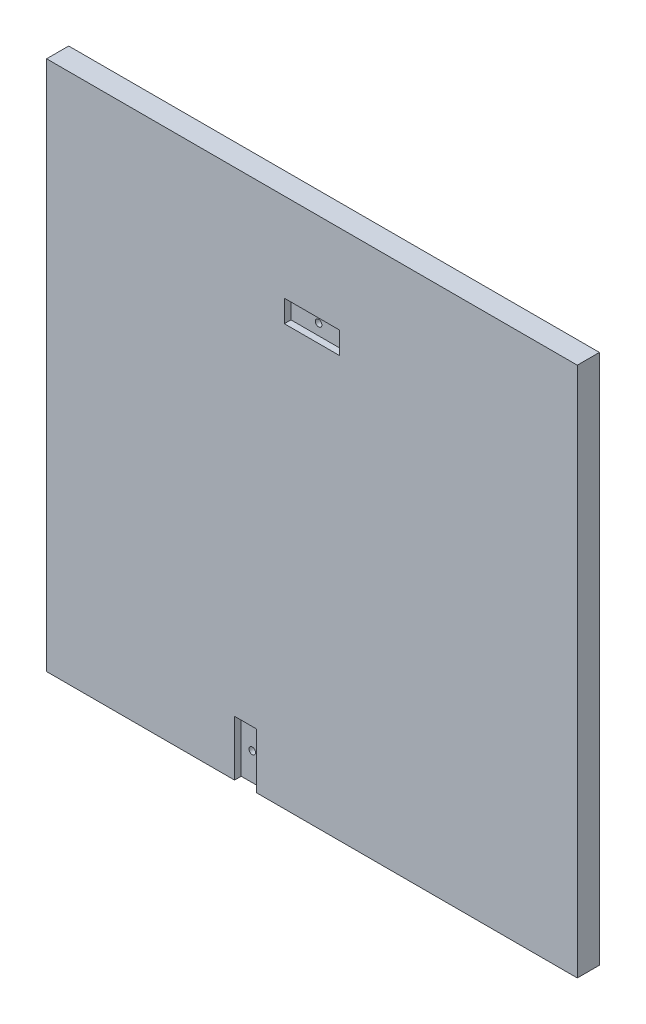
ISO-10303-21;
HEADER;
FILE_DESCRIPTION(('STEP AP214'),'2;1');
FILE_NAME('part.step','',(''),(''),'','','');
FILE_SCHEMA(('AUTOMOTIVE_DESIGN { 1 0 10303 214 1 1 1 1 }'));
ENDSEC;
DATA;
#1=APPLICATION_CONTEXT('core data for automotive mechanical design processes');
#2=APPLICATION_PROTOCOL_DEFINITION('international standard','automotive_design',2000,#1);
#3=PRODUCT_CONTEXT('',#1,'mechanical');
#4=PRODUCT('Part','Part','',(#3));
#5=PRODUCT_RELATED_PRODUCT_CATEGORY('part','',(#4));
#6=PRODUCT_DEFINITION_FORMATION('','',#4);
#7=PRODUCT_DEFINITION_CONTEXT('part definition',#1,'design');
#8=PRODUCT_DEFINITION('design','',#6,#7);
#9=PRODUCT_DEFINITION_SHAPE('','',#8);
#10=(LENGTH_UNIT() NAMED_UNIT(*) SI_UNIT(.MILLI.,.METRE.));
#11=(NAMED_UNIT(*) PLANE_ANGLE_UNIT() SI_UNIT($,.RADIAN.));
#12=(NAMED_UNIT(*) SI_UNIT($,.STERADIAN.) SOLID_ANGLE_UNIT());
#13=UNCERTAINTY_MEASURE_WITH_UNIT(LENGTH_MEASURE(1.E-05),#10,'distance_accuracy_value','');
#14=(GEOMETRIC_REPRESENTATION_CONTEXT(3) GLOBAL_UNCERTAINTY_ASSIGNED_CONTEXT((#13)) GLOBAL_UNIT_ASSIGNED_CONTEXT((#10,
#11,#12)) REPRESENTATION_CONTEXT('',''));
#15=CARTESIAN_POINT('',(0.,0.,0.));
#16=DIRECTION('',(0.,0.,1.));
#17=DIRECTION('',(1.,0.,0.));
#18=AXIS2_PLACEMENT_3D('',#15,#16,#17);
#19=CARTESIAN_POINT('',(120.,195.,0.));
#20=DIRECTION('',(0.,0.,1.));
#21=DIRECTION('',(1.,0.,0.));
#22=AXIS2_PLACEMENT_3D('',#19,#20,#21);
#23=CYLINDRICAL_SURFACE('',#22,1.5);
#24=CARTESIAN_POINT('',(120.,195.,0.));
#25=DIRECTION('',(0.,0.,1.));
#26=DIRECTION('',(1.,0.,0.));
#27=AXIS2_PLACEMENT_3D('',#24,#25,#26);
#28=CIRCLE('',#27,1.5);
#29=CARTESIAN_POINT('',(121.5,195.,0.));
#30=VERTEX_POINT('',#29);
#31=EDGE_CURVE('E191',#30,#30,#28,.T.);
#32=ORIENTED_EDGE('',*,*,#31,.F.);
#33=EDGE_LOOP('',(#32));
#34=FACE_BOUND('',#33,.T.);
#35=CARTESIAN_POINT('',(120.,195.,7.));
#36=DIRECTION('',(0.,0.,1.));
#37=DIRECTION('',(1.,0.,0.));
#38=AXIS2_PLACEMENT_3D('',#35,#36,#37);
#39=CIRCLE('',#38,1.5);
#40=CARTESIAN_POINT('',(121.5,195.,7.));
#41=VERTEX_POINT('',#40);
#42=EDGE_CURVE('E36',#41,#41,#39,.F.);
#43=ORIENTED_EDGE('',*,*,#42,.F.);
#44=EDGE_LOOP('',(#43));
#45=FACE_BOUND('',#44,.T.);
#46=ADVANCED_FACE('F32',(#34,#45),#23,.F.);
#47=CARTESIAN_POINT('',(90.,12.5,0.));
#48=DIRECTION('',(0.,0.,1.));
#49=DIRECTION('',(1.,0.,0.));
#50=AXIS2_PLACEMENT_3D('',#47,#48,#49);
#51=CYLINDRICAL_SURFACE('',#50,1.5);
#52=CARTESIAN_POINT('',(90.,12.5,0.));
#53=DIRECTION('',(0.,0.,1.));
#54=DIRECTION('',(1.,0.,0.));
#55=AXIS2_PLACEMENT_3D('',#52,#53,#54);
#56=CIRCLE('',#55,1.5);
#57=CARTESIAN_POINT('',(91.5,12.5,0.));
#58=VERTEX_POINT('',#57);
#59=EDGE_CURVE('E194',#58,#58,#56,.T.);
#60=ORIENTED_EDGE('',*,*,#59,.F.);
#61=EDGE_LOOP('',(#60));
#62=FACE_BOUND('',#61,.T.);
#63=CARTESIAN_POINT('',(90.,12.5,7.));
#64=DIRECTION('',(0.,0.,1.));
#65=DIRECTION('',(1.,0.,0.));
#66=AXIS2_PLACEMENT_3D('',#63,#64,#65);
#67=CIRCLE('',#66,1.5);
#68=CARTESIAN_POINT('',(91.5,12.5,7.));
#69=VERTEX_POINT('',#68);
#70=EDGE_CURVE('E185',#69,#69,#67,.F.);
#71=ORIENTED_EDGE('',*,*,#70,.F.);
#72=EDGE_LOOP('',(#71));
#73=FACE_BOUND('',#72,.T.);
#74=ADVANCED_FACE('F229',(#62,#73),#51,.F.);
#75=CARTESIAN_POINT('',(0.,0.,10.));
#76=DIRECTION('',(1.,0.,0.));
#77=DIRECTION('',(0.,0.,-1.));
#78=AXIS2_PLACEMENT_3D('',#75,#76,#77);
#79=PLANE('',#78);
#80=DIRECTION('',(0.,-1.,0.));
#81=VECTOR('',#80,1.);
#82=CARTESIAN_POINT('',(0.,0.,0.));
#83=LINE('',#82,#81);
#84=CARTESIAN_POINT('',(0.,240.,0.));
#85=VERTEX_POINT('',#84);
#86=CARTESIAN_POINT('',(0.,0.,0.));
#87=VERTEX_POINT('',#86);
#88=EDGE_CURVE('E197',#85,#87,#83,.T.);
#89=ORIENTED_EDGE('',*,*,#88,.T.);
#90=DIRECTION('',(0.,0.,-1.));
#91=VECTOR('',#90,1.);
#92=CARTESIAN_POINT('',(0.,0.,10.));
#93=LINE('',#92,#91);
#94=CARTESIAN_POINT('',(0.,0.,10.));
#95=VERTEX_POINT('',#94);
#96=EDGE_CURVE('E11',#95,#87,#93,.T.);
#97=ORIENTED_EDGE('',*,*,#96,.F.);
#98=DIRECTION('',(0.,-1.,0.));
#99=VECTOR('',#98,1.);
#100=CARTESIAN_POINT('',(0.,0.,10.));
#101=LINE('',#100,#99);
#102=CARTESIAN_POINT('',(0.,240.,10.));
#103=VERTEX_POINT('',#102);
#104=EDGE_CURVE('E198',#103,#95,#101,.T.);
#105=ORIENTED_EDGE('',*,*,#104,.F.);
#106=DIRECTION('',(0.,0.,-1.));
#107=VECTOR('',#106,1.);
#108=CARTESIAN_POINT('',(0.,240.,10.));
#109=LINE('',#108,#107);
#110=EDGE_CURVE('E210',#103,#85,#109,.T.);
#111=ORIENTED_EDGE('',*,*,#110,.T.);
#112=EDGE_LOOP('',(#89,#97,#105,#111));
#113=FACE_BOUND('',#112,.T.);
#114=ADVANCED_FACE('F34',(#113),#79,.F.);
#115=CARTESIAN_POINT('',(0.,0.,10.));
#116=DIRECTION('',(0.,1.,0.));
#117=DIRECTION('',(0.,0.,1.));
#118=AXIS2_PLACEMENT_3D('',#115,#116,#117);
#119=PLANE('',#118);
#120=DIRECTION('',(1.,0.,0.));
#121=VECTOR('',#120,1.);
#122=CARTESIAN_POINT('',(85.,0.,7.));
#123=LINE('',#122,#121);
#124=CARTESIAN_POINT('',(85.,0.,7.));
#125=VERTEX_POINT('',#124);
#126=CARTESIAN_POINT('',(95.,0.,7.));
#127=VERTEX_POINT('',#126);
#128=EDGE_CURVE('E166',#125,#127,#123,.T.);
#129=ORIENTED_EDGE('',*,*,#128,.F.);
#130=DIRECTION('',(0.,0.,1.));
#131=VECTOR('',#130,1.);
#132=CARTESIAN_POINT('',(85.,0.,7.));
#133=LINE('',#132,#131);
#134=CARTESIAN_POINT('',(85.,0.,10.));
#135=VERTEX_POINT('',#134);
#136=EDGE_CURVE('E176',#125,#135,#133,.T.);
#137=ORIENTED_EDGE('',*,*,#136,.T.);
#138=DIRECTION('',(1.,0.,0.));
#139=VECTOR('',#138,1.);
#140=CARTESIAN_POINT('',(0.,0.,10.));
#141=LINE('',#140,#139);
#142=EDGE_CURVE('E203',#95,#135,#141,.T.);
#143=ORIENTED_EDGE('',*,*,#142,.F.);
#144=ORIENTED_EDGE('',*,*,#96,.T.);
#145=DIRECTION('',(1.,0.,0.));
#146=VECTOR('',#145,1.);
#147=CARTESIAN_POINT('',(0.,0.,0.));
#148=LINE('',#147,#146);
#149=CARTESIAN_POINT('',(240.,0.,0.));
#150=VERTEX_POINT('',#149);
#151=EDGE_CURVE('E213',#87,#150,#148,.T.);
#152=ORIENTED_EDGE('',*,*,#151,.T.);
#153=DIRECTION('',(0.,0.,-1.));
#154=VECTOR('',#153,1.);
#155=CARTESIAN_POINT('',(240.,0.,10.));
#156=LINE('',#155,#154);
#157=CARTESIAN_POINT('',(240.,0.,10.));
#158=VERTEX_POINT('',#157);
#159=EDGE_CURVE('E41',#158,#150,#156,.T.);
#160=ORIENTED_EDGE('',*,*,#159,.F.);
#161=CARTESIAN_POINT('',(95.,0.,10.));
#162=VERTEX_POINT('',#161);
#163=EDGE_CURVE('E201',#162,#158,#141,.T.);
#164=ORIENTED_EDGE('',*,*,#163,.F.);
#165=DIRECTION('',(0.,0.,1.));
#166=VECTOR('',#165,1.);
#167=CARTESIAN_POINT('',(95.,0.,7.));
#168=LINE('',#167,#166);
#169=EDGE_CURVE('E57',#127,#162,#168,.T.);
#170=ORIENTED_EDGE('',*,*,#169,.F.);
#171=EDGE_LOOP('',(#129,#137,#143,#144,#152,#160,#164,#170));
#172=FACE_BOUND('',#171,.T.);
#173=ADVANCED_FACE('F237',(#172),#119,.F.);
#174=CARTESIAN_POINT('',(240.,0.,10.));
#175=DIRECTION('',(-1.,0.,0.));
#176=DIRECTION('',(0.,0.,1.));
#177=AXIS2_PLACEMENT_3D('',#174,#175,#176);
#178=PLANE('',#177);
#179=DIRECTION('',(0.,1.,0.));
#180=VECTOR('',#179,1.);
#181=CARTESIAN_POINT('',(240.,0.,0.));
#182=LINE('',#181,#180);
#183=CARTESIAN_POINT('',(240.,240.,0.));
#184=VERTEX_POINT('',#183);
#185=EDGE_CURVE('E215',#150,#184,#182,.T.);
#186=ORIENTED_EDGE('',*,*,#185,.T.);
#187=DIRECTION('',(0.,0.,-1.));
#188=VECTOR('',#187,1.);
#189=CARTESIAN_POINT('',(240.,240.,10.));
#190=LINE('',#189,#188);
#191=CARTESIAN_POINT('',(240.,240.,10.));
#192=VERTEX_POINT('',#191);
#193=EDGE_CURVE('E220',#192,#184,#190,.T.);
#194=ORIENTED_EDGE('',*,*,#193,.F.);
#195=DIRECTION('',(0.,1.,0.));
#196=VECTOR('',#195,1.);
#197=CARTESIAN_POINT('',(240.,0.,10.));
#198=LINE('',#197,#196);
#199=EDGE_CURVE('E206',#158,#192,#198,.T.);
#200=ORIENTED_EDGE('',*,*,#199,.F.);
#201=ORIENTED_EDGE('',*,*,#159,.T.);
#202=EDGE_LOOP('',(#186,#194,#200,#201));
#203=FACE_BOUND('',#202,.T.);
#204=ADVANCED_FACE('F255',(#203),#178,.F.);
#205=CARTESIAN_POINT('',(0.,240.,10.));
#206=DIRECTION('',(0.,-1.,0.));
#207=DIRECTION('',(0.,0.,-1.));
#208=AXIS2_PLACEMENT_3D('',#205,#206,#207);
#209=PLANE('',#208);
#210=DIRECTION('',(-1.,0.,0.));
#211=VECTOR('',#210,1.);
#212=CARTESIAN_POINT('',(0.,240.,0.));
#213=LINE('',#212,#211);
#214=EDGE_CURVE('E202',#184,#85,#213,.T.);
#215=ORIENTED_EDGE('',*,*,#214,.T.);
#216=ORIENTED_EDGE('',*,*,#110,.F.);
#217=DIRECTION('',(-1.,0.,0.));
#218=VECTOR('',#217,1.);
#219=CARTESIAN_POINT('',(0.,240.,10.));
#220=LINE('',#219,#218);
#221=EDGE_CURVE('E208',#192,#103,#220,.T.);
#222=ORIENTED_EDGE('',*,*,#221,.F.);
#223=ORIENTED_EDGE('',*,*,#193,.T.);
#224=EDGE_LOOP('',(#215,#216,#222,#223));
#225=FACE_BOUND('',#224,.T.);
#226=ADVANCED_FACE('F248',(#225),#209,.F.);
#227=CARTESIAN_POINT('',(0.,0.,10.));
#228=DIRECTION('',(0.,0.,-1.));
#229=DIRECTION('',(-1.,0.,0.));
#230=AXIS2_PLACEMENT_3D('',#227,#228,#229);
#231=PLANE('',#230);
#232=DIRECTION('',(1.,0.,0.));
#233=VECTOR('',#232,1.);
#234=CARTESIAN_POINT('',(107.5,190.,10.));
#235=LINE('',#234,#233);
#236=CARTESIAN_POINT('',(107.5,190.,10.));
#237=VERTEX_POINT('',#236);
#238=CARTESIAN_POINT('',(132.5,190.,10.));
#239=VERTEX_POINT('',#238);
#240=EDGE_CURVE('E154',#237,#239,#235,.T.);
#241=ORIENTED_EDGE('',*,*,#240,.F.);
#242=DIRECTION('',(0.,-1.,0.));
#243=VECTOR('',#242,1.);
#244=CARTESIAN_POINT('',(107.5,200.,10.));
#245=LINE('',#244,#243);
#246=CARTESIAN_POINT('',(107.5,200.,10.));
#247=VERTEX_POINT('',#246);
#248=EDGE_CURVE('E49',#247,#237,#245,.T.);
#249=ORIENTED_EDGE('',*,*,#248,.F.);
#250=DIRECTION('',(-1.,0.,0.));
#251=VECTOR('',#250,1.);
#252=CARTESIAN_POINT('',(107.5,200.,10.));
#253=LINE('',#252,#251);
#254=CARTESIAN_POINT('',(132.5,200.,10.));
#255=VERTEX_POINT('',#254);
#256=EDGE_CURVE('E145',#255,#247,#253,.T.);
#257=ORIENTED_EDGE('',*,*,#256,.F.);
#258=DIRECTION('',(0.,1.,0.));
#259=VECTOR('',#258,1.);
#260=CARTESIAN_POINT('',(132.5,200.,10.));
#261=LINE('',#260,#259);
#262=EDGE_CURVE('E148',#239,#255,#261,.T.);
#263=ORIENTED_EDGE('',*,*,#262,.F.);
#264=EDGE_LOOP('',(#241,#249,#257,#263));
#265=FACE_BOUND('',#264,.T.);
#266=ORIENTED_EDGE('',*,*,#142,.T.);
#267=DIRECTION('',(0.,-1.,0.));
#268=VECTOR('',#267,1.);
#269=CARTESIAN_POINT('',(85.,25.,10.));
#270=LINE('',#269,#268);
#271=CARTESIAN_POINT('',(85.,25.,10.));
#272=VERTEX_POINT('',#271);
#273=EDGE_CURVE('E177',#272,#135,#270,.T.);
#274=ORIENTED_EDGE('',*,*,#273,.F.);
#275=DIRECTION('',(-1.,0.,0.));
#276=VECTOR('',#275,1.);
#277=CARTESIAN_POINT('',(85.,25.,10.));
#278=LINE('',#277,#276);
#279=CARTESIAN_POINT('',(95.,25.,10.));
#280=VERTEX_POINT('',#279);
#281=EDGE_CURVE('E167',#280,#272,#278,.T.);
#282=ORIENTED_EDGE('',*,*,#281,.F.);
#283=DIRECTION('',(0.,1.,0.));
#284=VECTOR('',#283,1.);
#285=CARTESIAN_POINT('',(95.,25.,10.));
#286=LINE('',#285,#284);
#287=EDGE_CURVE('E179',#162,#280,#286,.T.);
#288=ORIENTED_EDGE('',*,*,#287,.F.);
#289=ORIENTED_EDGE('',*,*,#163,.T.);
#290=ORIENTED_EDGE('',*,*,#199,.T.);
#291=ORIENTED_EDGE('',*,*,#221,.T.);
#292=ORIENTED_EDGE('',*,*,#104,.T.);
#293=EDGE_LOOP('',(#266,#274,#282,#288,#289,#290,#291,#292));
#294=FACE_BOUND('',#293,.T.);
#295=ADVANCED_FACE('F244',(#265,#294),#231,.F.);
#296=CARTESIAN_POINT('',(0.,0.,0.));
#297=DIRECTION('',(0.,0.,-1.));
#298=DIRECTION('',(-1.,0.,0.));
#299=AXIS2_PLACEMENT_3D('',#296,#297,#298);
#300=PLANE('',#299);
#301=ORIENTED_EDGE('',*,*,#31,.T.);
#302=EDGE_LOOP('',(#301));
#303=FACE_BOUND('',#302,.T.);
#304=ORIENTED_EDGE('',*,*,#59,.T.);
#305=EDGE_LOOP('',(#304));
#306=FACE_BOUND('',#305,.T.);
#307=ORIENTED_EDGE('',*,*,#88,.F.);
#308=ORIENTED_EDGE('',*,*,#214,.F.);
#309=ORIENTED_EDGE('',*,*,#185,.F.);
#310=ORIENTED_EDGE('',*,*,#151,.F.);
#311=EDGE_LOOP('',(#307,#308,#309,#310));
#312=FACE_BOUND('',#311,.T.);
#313=ADVANCED_FACE('F247',(#303,#306,#312),#300,.T.);
#314=CARTESIAN_POINT('',(0.,0.,7.));
#315=DIRECTION('',(0.,0.,1.));
#316=DIRECTION('',(1.,0.,0.));
#317=AXIS2_PLACEMENT_3D('',#314,#315,#316);
#318=PLANE('',#317);
#319=DIRECTION('',(0.,-1.,0.));
#320=VECTOR('',#319,1.);
#321=CARTESIAN_POINT('',(85.,25.,7.));
#322=LINE('',#321,#320);
#323=CARTESIAN_POINT('',(85.,25.,7.));
#324=VERTEX_POINT('',#323);
#325=EDGE_CURVE('E163',#324,#125,#322,.T.);
#326=ORIENTED_EDGE('',*,*,#325,.T.);
#327=ORIENTED_EDGE('',*,*,#128,.T.);
#328=DIRECTION('',(0.,1.,0.));
#329=VECTOR('',#328,1.);
#330=CARTESIAN_POINT('',(95.,25.,7.));
#331=LINE('',#330,#329);
#332=CARTESIAN_POINT('',(95.,25.,7.));
#333=VERTEX_POINT('',#332);
#334=EDGE_CURVE('E170',#127,#333,#331,.T.);
#335=ORIENTED_EDGE('',*,*,#334,.T.);
#336=DIRECTION('',(-1.,0.,0.));
#337=VECTOR('',#336,1.);
#338=CARTESIAN_POINT('',(85.,25.,7.));
#339=LINE('',#338,#337);
#340=EDGE_CURVE('E173',#333,#324,#339,.T.);
#341=ORIENTED_EDGE('',*,*,#340,.T.);
#342=EDGE_LOOP('',(#326,#327,#335,#341));
#343=FACE_BOUND('',#342,.T.);
#344=ORIENTED_EDGE('',*,*,#70,.T.);
#345=EDGE_LOOP('',(#344));
#346=FACE_BOUND('',#345,.T.);
#347=ADVANCED_FACE('F227',(#343,#346),#318,.T.);
#348=CARTESIAN_POINT('',(85.,25.,7.));
#349=DIRECTION('',(-1.,0.,0.));
#350=DIRECTION('',(0.,0.,1.));
#351=AXIS2_PLACEMENT_3D('',#348,#349,#350);
#352=PLANE('',#351);
#353=ORIENTED_EDGE('',*,*,#273,.T.);
#354=ORIENTED_EDGE('',*,*,#136,.F.);
#355=ORIENTED_EDGE('',*,*,#325,.F.);
#356=DIRECTION('',(0.,0.,1.));
#357=VECTOR('',#356,1.);
#358=CARTESIAN_POINT('',(85.,25.,7.));
#359=LINE('',#358,#357);
#360=EDGE_CURVE('E183',#324,#272,#359,.T.);
#361=ORIENTED_EDGE('',*,*,#360,.T.);
#362=EDGE_LOOP('',(#353,#354,#355,#361));
#363=FACE_BOUND('',#362,.T.);
#364=ADVANCED_FACE('F269',(#363),#352,.F.);
#365=CARTESIAN_POINT('',(85.,25.,7.));
#366=DIRECTION('',(0.,1.,0.));
#367=DIRECTION('',(0.,0.,1.));
#368=AXIS2_PLACEMENT_3D('',#365,#366,#367);
#369=PLANE('',#368);
#370=ORIENTED_EDGE('',*,*,#281,.T.);
#371=ORIENTED_EDGE('',*,*,#360,.F.);
#372=ORIENTED_EDGE('',*,*,#340,.F.);
#373=DIRECTION('',(0.,0.,1.));
#374=VECTOR('',#373,1.);
#375=CARTESIAN_POINT('',(95.,25.,7.));
#376=LINE('',#375,#374);
#377=EDGE_CURVE('E186',#333,#280,#376,.T.);
#378=ORIENTED_EDGE('',*,*,#377,.T.);
#379=EDGE_LOOP('',(#370,#371,#372,#378));
#380=FACE_BOUND('',#379,.T.);
#381=ADVANCED_FACE('F286',(#380),#369,.F.);
#382=CARTESIAN_POINT('',(95.,25.,7.));
#383=DIRECTION('',(1.,0.,0.));
#384=DIRECTION('',(0.,0.,-1.));
#385=AXIS2_PLACEMENT_3D('',#382,#383,#384);
#386=PLANE('',#385);
#387=ORIENTED_EDGE('',*,*,#287,.T.);
#388=ORIENTED_EDGE('',*,*,#377,.F.);
#389=ORIENTED_EDGE('',*,*,#334,.F.);
#390=ORIENTED_EDGE('',*,*,#169,.T.);
#391=EDGE_LOOP('',(#387,#388,#389,#390));
#392=FACE_BOUND('',#391,.T.);
#393=ADVANCED_FACE('F284',(#392),#386,.F.);
#394=CARTESIAN_POINT('',(0.,0.,7.));
#395=DIRECTION('',(0.,0.,1.));
#396=DIRECTION('',(1.,0.,0.));
#397=AXIS2_PLACEMENT_3D('',#394,#395,#396);
#398=PLANE('',#397);
#399=DIRECTION('',(0.,-1.,0.));
#400=VECTOR('',#399,1.);
#401=CARTESIAN_POINT('',(107.5,200.,7.));
#402=LINE('',#401,#400);
#403=CARTESIAN_POINT('',(107.5,200.,7.));
#404=VERTEX_POINT('',#403);
#405=CARTESIAN_POINT('',(107.5,190.,7.));
#406=VERTEX_POINT('',#405);
#407=EDGE_CURVE('E126',#404,#406,#402,.T.);
#408=ORIENTED_EDGE('',*,*,#407,.T.);
#409=DIRECTION('',(1.,0.,0.));
#410=VECTOR('',#409,1.);
#411=CARTESIAN_POINT('',(107.5,190.,7.));
#412=LINE('',#411,#410);
#413=CARTESIAN_POINT('',(132.5,190.,7.));
#414=VERTEX_POINT('',#413);
#415=EDGE_CURVE('E135',#406,#414,#412,.T.);
#416=ORIENTED_EDGE('',*,*,#415,.T.);
#417=DIRECTION('',(0.,1.,0.));
#418=VECTOR('',#417,1.);
#419=CARTESIAN_POINT('',(132.5,200.,7.));
#420=LINE('',#419,#418);
#421=CARTESIAN_POINT('',(132.5,200.,7.));
#422=VERTEX_POINT('',#421);
#423=EDGE_CURVE('E140',#414,#422,#420,.T.);
#424=ORIENTED_EDGE('',*,*,#423,.T.);
#425=DIRECTION('',(-1.,0.,0.));
#426=VECTOR('',#425,1.);
#427=CARTESIAN_POINT('',(107.5,200.,7.));
#428=LINE('',#427,#426);
#429=EDGE_CURVE('E132',#422,#404,#428,.T.);
#430=ORIENTED_EDGE('',*,*,#429,.T.);
#431=EDGE_LOOP('',(#408,#416,#424,#430));
#432=FACE_BOUND('',#431,.T.);
#433=ORIENTED_EDGE('',*,*,#42,.T.);
#434=EDGE_LOOP('',(#433));
#435=FACE_BOUND('',#434,.T.);
#436=ADVANCED_FACE('F142',(#432,#435),#398,.T.);
#437=CARTESIAN_POINT('',(107.5,200.,7.));
#438=DIRECTION('',(-1.,0.,0.));
#439=DIRECTION('',(0.,-1.,0.));
#440=AXIS2_PLACEMENT_3D('',#437,#438,#439);
#441=PLANE('',#440);
#442=ORIENTED_EDGE('',*,*,#248,.T.);
#443=DIRECTION('',(0.,0.,1.));
#444=VECTOR('',#443,1.);
#445=CARTESIAN_POINT('',(107.5,190.,7.));
#446=LINE('',#445,#444);
#447=EDGE_CURVE('E122',#406,#237,#446,.T.);
#448=ORIENTED_EDGE('',*,*,#447,.F.);
#449=ORIENTED_EDGE('',*,*,#407,.F.);
#450=DIRECTION('',(0.,0.,1.));
#451=VECTOR('',#450,1.);
#452=CARTESIAN_POINT('',(107.5,200.,7.));
#453=LINE('',#452,#451);
#454=EDGE_CURVE('E158',#404,#247,#453,.T.);
#455=ORIENTED_EDGE('',*,*,#454,.T.);
#456=EDGE_LOOP('',(#442,#448,#449,#455));
#457=FACE_BOUND('',#456,.T.);
#458=ADVANCED_FACE('F124',(#457),#441,.F.);
#459=CARTESIAN_POINT('',(107.5,200.,7.));
#460=DIRECTION('',(0.,1.,0.));
#461=DIRECTION('',(0.,0.,1.));
#462=AXIS2_PLACEMENT_3D('',#459,#460,#461);
#463=PLANE('',#462);
#464=ORIENTED_EDGE('',*,*,#256,.T.);
#465=ORIENTED_EDGE('',*,*,#454,.F.);
#466=ORIENTED_EDGE('',*,*,#429,.F.);
#467=DIRECTION('',(0.,0.,1.));
#468=VECTOR('',#467,1.);
#469=CARTESIAN_POINT('',(132.5,200.,7.));
#470=LINE('',#469,#468);
#471=EDGE_CURVE('E160',#422,#255,#470,.T.);
#472=ORIENTED_EDGE('',*,*,#471,.T.);
#473=EDGE_LOOP('',(#464,#465,#466,#472));
#474=FACE_BOUND('',#473,.T.);
#475=ADVANCED_FACE('F299',(#474),#463,.F.);
#476=CARTESIAN_POINT('',(132.5,200.,7.));
#477=DIRECTION('',(1.,0.,0.));
#478=DIRECTION('',(0.,0.,-1.));
#479=AXIS2_PLACEMENT_3D('',#476,#477,#478);
#480=PLANE('',#479);
#481=ORIENTED_EDGE('',*,*,#262,.T.);
#482=ORIENTED_EDGE('',*,*,#471,.F.);
#483=ORIENTED_EDGE('',*,*,#423,.F.);
#484=DIRECTION('',(0.,0.,1.));
#485=VECTOR('',#484,1.);
#486=CARTESIAN_POINT('',(132.5,190.,7.));
#487=LINE('',#486,#485);
#488=EDGE_CURVE('E131',#414,#239,#487,.T.);
#489=ORIENTED_EDGE('',*,*,#488,.T.);
#490=EDGE_LOOP('',(#481,#482,#483,#489));
#491=FACE_BOUND('',#490,.T.);
#492=ADVANCED_FACE('F302',(#491),#480,.F.);
#493=CARTESIAN_POINT('',(107.5,190.,7.));
#494=DIRECTION('',(0.,-1.,0.));
#495=DIRECTION('',(0.,0.,-1.));
#496=AXIS2_PLACEMENT_3D('',#493,#494,#495);
#497=PLANE('',#496);
#498=ORIENTED_EDGE('',*,*,#240,.T.);
#499=ORIENTED_EDGE('',*,*,#488,.F.);
#500=ORIENTED_EDGE('',*,*,#415,.F.);
#501=ORIENTED_EDGE('',*,*,#447,.T.);
#502=EDGE_LOOP('',(#498,#499,#500,#501));
#503=FACE_BOUND('',#502,.T.);
#504=ADVANCED_FACE('F136',(#503),#497,.F.);
#505=CLOSED_SHELL('',(#46,#74,#114,#173,#204,#226,#295,#313,#347,#364,#381,#393,#436,#458,#475,
#492,#504));
#506=MANIFOLD_SOLID_BREP('B2',#505);
#507=ADVANCED_BREP_SHAPE_REPRESENTATION('',(#18,#506),#14);
#508=SHAPE_DEFINITION_REPRESENTATION(#9,#507);
ENDSEC;
END-ISO-10303-21;
